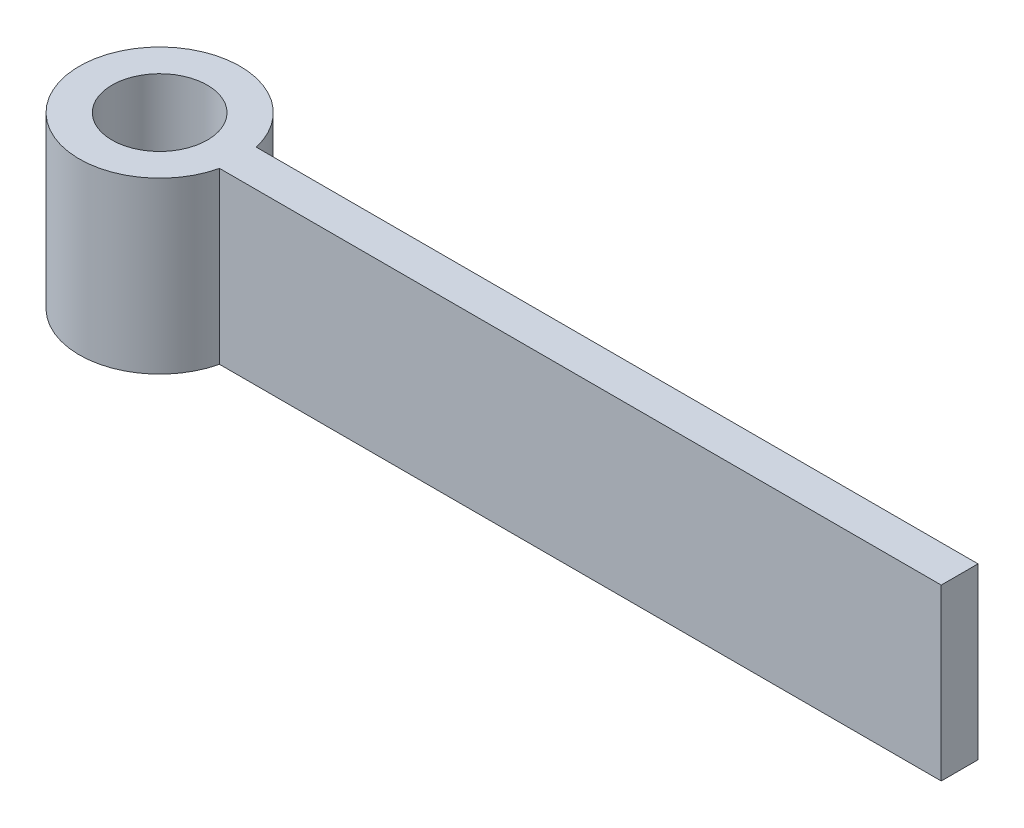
ISO-10303-21;
HEADER;
FILE_DESCRIPTION(('STEP AP214'),'2;1');
FILE_NAME('part.step','',(''),(''),'','','');
FILE_SCHEMA(('AUTOMOTIVE_DESIGN { 1 0 10303 214 1 1 1 1 }'));
ENDSEC;
DATA;
#1=APPLICATION_CONTEXT('core data for automotive mechanical design processes');
#2=APPLICATION_PROTOCOL_DEFINITION('international standard','automotive_design',2000,#1);
#3=PRODUCT_CONTEXT('',#1,'mechanical');
#4=PRODUCT('Part','Part','',(#3));
#5=PRODUCT_RELATED_PRODUCT_CATEGORY('part','',(#4));
#6=PRODUCT_DEFINITION_FORMATION('','',#4);
#7=PRODUCT_DEFINITION_CONTEXT('part definition',#1,'design');
#8=PRODUCT_DEFINITION('design','',#6,#7);
#9=PRODUCT_DEFINITION_SHAPE('','',#8);
#10=(LENGTH_UNIT() NAMED_UNIT(*) SI_UNIT(.MILLI.,.METRE.));
#11=(NAMED_UNIT(*) PLANE_ANGLE_UNIT() SI_UNIT($,.RADIAN.));
#12=(NAMED_UNIT(*) SI_UNIT($,.STERADIAN.) SOLID_ANGLE_UNIT());
#13=UNCERTAINTY_MEASURE_WITH_UNIT(LENGTH_MEASURE(1.E-05),#10,'distance_accuracy_value','');
#14=(GEOMETRIC_REPRESENTATION_CONTEXT(3) GLOBAL_UNCERTAINTY_ASSIGNED_CONTEXT((#13)) GLOBAL_UNIT_ASSIGNED_CONTEXT((#10,
#11,#12)) REPRESENTATION_CONTEXT('',''));
#15=CARTESIAN_POINT('',(0.,0.,0.));
#16=DIRECTION('',(0.,0.,1.));
#17=DIRECTION('',(1.,0.,0.));
#18=AXIS2_PLACEMENT_3D('',#15,#16,#17);
#19=CARTESIAN_POINT('',(0.,110.236,0.));
#20=DIRECTION('',(0.,1.,0.));
#21=DIRECTION('',(0.,0.,1.));
#22=AXIS2_PLACEMENT_3D('',#19,#20,#21);
#23=PLANE('',#22);
#24=CARTESIAN_POINT('',(0.,110.236,0.));
#25=DIRECTION('',(0.,1.,0.));
#26=DIRECTION('',(0.,0.,1.));
#27=AXIS2_PLACEMENT_3D('',#24,#25,#26);
#28=CIRCLE('',#27,30.9556897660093);
#29=CARTESIAN_POINT('',(0.,110.236,30.9556897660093));
#30=VERTEX_POINT('',#29);
#31=EDGE_CURVE('E102',#30,#30,#28,.T.);
#32=ORIENTED_EDGE('',*,*,#31,.F.);
#33=EDGE_LOOP('',(#32));
#34=FACE_BOUND('',#33,.T.);
#35=CARTESIAN_POINT('',(0.,110.236,0.));
#36=DIRECTION('',(0.,1.,0.));
#37=DIRECTION('',(0.,0.,1.));
#38=AXIS2_PLACEMENT_3D('',#35,#36,#37);
#39=CIRCLE('',#38,52.2116383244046);
#40=CARTESIAN_POINT('',(50.8285287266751,110.236,-11.938));
#41=VERTEX_POINT('',#40);
#42=CARTESIAN_POINT('',(50.8285287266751,110.236,11.938));
#43=VERTEX_POINT('',#42);
#44=EDGE_CURVE('E107',#41,#43,#39,.T.);
#45=ORIENTED_EDGE('',*,*,#44,.T.);
#46=DIRECTION('',(-1.,0.,0.));
#47=VECTOR('',#46,1.);
#48=CARTESIAN_POINT('',(30.9556897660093,110.236,11.938));
#49=LINE('',#48,#47);
#50=CARTESIAN_POINT('',(519.602887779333,110.236,11.938));
#51=VERTEX_POINT('',#50);
#52=EDGE_CURVE('E92',#51,#43,#49,.T.);
#53=ORIENTED_EDGE('',*,*,#52,.F.);
#54=DIRECTION('',(0.,0.,-1.));
#55=VECTOR('',#54,1.);
#56=CARTESIAN_POINT('',(519.602887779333,110.236,11.938));
#57=LINE('',#56,#55);
#58=CARTESIAN_POINT('',(519.602887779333,110.236,-11.938));
#59=VERTEX_POINT('',#58);
#60=EDGE_CURVE('E87',#51,#59,#57,.T.);
#61=ORIENTED_EDGE('',*,*,#60,.T.);
#62=DIRECTION('',(-1.,0.,0.));
#63=VECTOR('',#62,1.);
#64=CARTESIAN_POINT('',(30.9556897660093,110.236,-11.938));
#65=LINE('',#64,#63);
#66=EDGE_CURVE('E77',#59,#41,#65,.T.);
#67=ORIENTED_EDGE('',*,*,#66,.T.);
#68=EDGE_LOOP('',(#45,#53,#61,#67));
#69=FACE_BOUND('',#68,.T.);
#70=ADVANCED_FACE('F33',(#34,#69),#23,.T.);
#71=CARTESIAN_POINT('',(0.,0.,0.));
#72=DIRECTION('',(0.,1.,0.));
#73=DIRECTION('',(0.,0.,1.));
#74=AXIS2_PLACEMENT_3D('',#71,#72,#73);
#75=PLANE('',#74);
#76=CARTESIAN_POINT('',(0.,0.,0.));
#77=DIRECTION('',(0.,1.,0.));
#78=DIRECTION('',(0.,0.,1.));
#79=AXIS2_PLACEMENT_3D('',#76,#77,#78);
#80=CIRCLE('',#79,30.9556897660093);
#81=CARTESIAN_POINT('',(0.,0.,30.9556897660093));
#82=VERTEX_POINT('',#81);
#83=EDGE_CURVE('E86',#82,#82,#80,.T.);
#84=ORIENTED_EDGE('',*,*,#83,.T.);
#85=EDGE_LOOP('',(#84));
#86=FACE_BOUND('',#85,.T.);
#87=DIRECTION('',(1.,0.,0.));
#88=VECTOR('',#87,1.);
#89=CARTESIAN_POINT('',(30.9556897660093,0.,11.938));
#90=LINE('',#89,#88);
#91=CARTESIAN_POINT('',(50.8285287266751,0.,11.938));
#92=VERTEX_POINT('',#91);
#93=CARTESIAN_POINT('',(519.602887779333,0.,11.938));
#94=VERTEX_POINT('',#93);
#95=EDGE_CURVE('E69',#92,#94,#90,.T.);
#96=ORIENTED_EDGE('',*,*,#95,.F.);
#97=CARTESIAN_POINT('',(0.,0.,0.));
#98=DIRECTION('',(0.,1.,0.));
#99=DIRECTION('',(0.,0.,1.));
#100=AXIS2_PLACEMENT_3D('',#97,#98,#99);
#101=CIRCLE('',#100,52.2116383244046);
#102=CARTESIAN_POINT('',(50.8285287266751,0.,-11.938));
#103=VERTEX_POINT('',#102);
#104=EDGE_CURVE('E50',#103,#92,#101,.T.);
#105=ORIENTED_EDGE('',*,*,#104,.F.);
#106=DIRECTION('',(1.,0.,0.));
#107=VECTOR('',#106,1.);
#108=CARTESIAN_POINT('',(30.9556897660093,0.,-11.938));
#109=LINE('',#108,#107);
#110=CARTESIAN_POINT('',(519.602887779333,0.,-11.938));
#111=VERTEX_POINT('',#110);
#112=EDGE_CURVE('E83',#103,#111,#109,.T.);
#113=ORIENTED_EDGE('',*,*,#112,.T.);
#114=DIRECTION('',(0.,0.,-1.));
#115=VECTOR('',#114,1.);
#116=CARTESIAN_POINT('',(519.602887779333,0.,11.938));
#117=LINE('',#116,#115);
#118=EDGE_CURVE('E80',#94,#111,#117,.T.);
#119=ORIENTED_EDGE('',*,*,#118,.F.);
#120=EDGE_LOOP('',(#96,#105,#113,#119));
#121=FACE_BOUND('',#120,.T.);
#122=ADVANCED_FACE('F81',(#86,#121),#75,.F.);
#123=CARTESIAN_POINT('',(0.,110.236,0.));
#124=DIRECTION('',(0.,-1.,0.));
#125=DIRECTION('',(0.,0.,-1.));
#126=AXIS2_PLACEMENT_3D('',#123,#124,#125);
#127=CYLINDRICAL_SURFACE('',#126,52.2116383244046);
#128=ORIENTED_EDGE('',*,*,#104,.T.);
#129=DIRECTION('',(0.,-1.,0.));
#130=VECTOR('',#129,1.);
#131=CARTESIAN_POINT('',(50.8285287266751,110.236,11.938));
#132=LINE('',#131,#130);
#133=EDGE_CURVE('E11',#92,#43,#132,.F.);
#134=ORIENTED_EDGE('',*,*,#133,.T.);
#135=ORIENTED_EDGE('',*,*,#44,.F.);
#136=DIRECTION('',(0.,-1.,0.));
#137=VECTOR('',#136,1.);
#138=CARTESIAN_POINT('',(50.8285287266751,110.236,-11.938));
#139=LINE('',#138,#137);
#140=EDGE_CURVE('E41',#103,#41,#139,.F.);
#141=ORIENTED_EDGE('',*,*,#140,.F.);
#142=EDGE_LOOP('',(#128,#134,#135,#141));
#143=FACE_BOUND('',#142,.T.);
#144=ADVANCED_FACE('F35',(#143),#127,.T.);
#145=CARTESIAN_POINT('',(0.,110.236,0.));
#146=DIRECTION('',(0.,-1.,0.));
#147=DIRECTION('',(0.,0.,-1.));
#148=AXIS2_PLACEMENT_3D('',#145,#146,#147);
#149=CYLINDRICAL_SURFACE('',#148,30.9556897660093);
#150=ORIENTED_EDGE('',*,*,#83,.F.);
#151=EDGE_LOOP('',(#150));
#152=FACE_BOUND('',#151,.T.);
#153=ORIENTED_EDGE('',*,*,#31,.T.);
#154=EDGE_LOOP('',(#153));
#155=FACE_BOUND('',#154,.T.);
#156=ADVANCED_FACE('F115',(#152,#155),#149,.F.);
#157=CARTESIAN_POINT('',(30.9556897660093,0.,11.938));
#158=DIRECTION('',(0.,0.,1.));
#159=DIRECTION('',(1.,0.,0.));
#160=AXIS2_PLACEMENT_3D('',#157,#158,#159);
#161=PLANE('',#160);
#162=ORIENTED_EDGE('',*,*,#133,.F.);
#163=ORIENTED_EDGE('',*,*,#95,.T.);
#164=DIRECTION('',(0.,1.,0.));
#165=VECTOR('',#164,1.);
#166=CARTESIAN_POINT('',(519.602887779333,110.236,11.938));
#167=LINE('',#166,#165);
#168=EDGE_CURVE('E74',#94,#51,#167,.T.);
#169=ORIENTED_EDGE('',*,*,#168,.T.);
#170=ORIENTED_EDGE('',*,*,#52,.T.);
#171=EDGE_LOOP('',(#162,#163,#169,#170));
#172=FACE_BOUND('',#171,.T.);
#173=ADVANCED_FACE('F71',(#172),#161,.T.);
#174=CARTESIAN_POINT('',(30.9556897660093,0.,-11.938));
#175=DIRECTION('',(0.,0.,1.));
#176=DIRECTION('',(1.,0.,0.));
#177=AXIS2_PLACEMENT_3D('',#174,#175,#176);
#178=PLANE('',#177);
#179=ORIENTED_EDGE('',*,*,#112,.F.);
#180=ORIENTED_EDGE('',*,*,#140,.T.);
#181=ORIENTED_EDGE('',*,*,#66,.F.);
#182=DIRECTION('',(0.,1.,0.));
#183=VECTOR('',#182,1.);
#184=CARTESIAN_POINT('',(519.602887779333,110.236,-11.938));
#185=LINE('',#184,#183);
#186=EDGE_CURVE('E97',#111,#59,#185,.T.);
#187=ORIENTED_EDGE('',*,*,#186,.F.);
#188=EDGE_LOOP('',(#179,#180,#181,#187));
#189=FACE_BOUND('',#188,.T.);
#190=ADVANCED_FACE('F112',(#189),#178,.F.);
#191=CARTESIAN_POINT('',(519.602887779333,110.236,11.938));
#192=DIRECTION('',(-1.,0.,0.));
#193=DIRECTION('',(0.,0.,1.));
#194=AXIS2_PLACEMENT_3D('',#191,#192,#193);
#195=PLANE('',#194);
#196=ORIENTED_EDGE('',*,*,#186,.T.);
#197=ORIENTED_EDGE('',*,*,#60,.F.);
#198=ORIENTED_EDGE('',*,*,#168,.F.);
#199=ORIENTED_EDGE('',*,*,#118,.T.);
#200=EDGE_LOOP('',(#196,#197,#198,#199));
#201=FACE_BOUND('',#200,.T.);
#202=ADVANCED_FACE('F89',(#201),#195,.F.);
#203=CLOSED_SHELL('',(#70,#122,#144,#156,#173,#190,#202));
#204=MANIFOLD_SOLID_BREP('B2',#203);
#205=ADVANCED_BREP_SHAPE_REPRESENTATION('',(#18,#204),#14);
#206=SHAPE_DEFINITION_REPRESENTATION(#9,#205);
ENDSEC;
END-ISO-10303-21;
